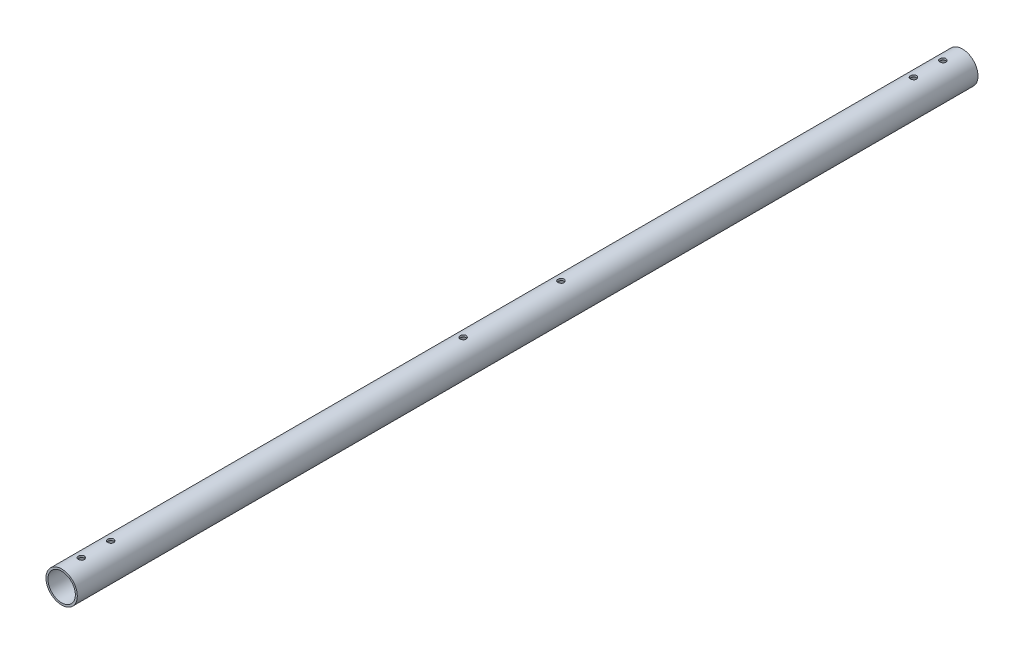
from build123d import *

# Parameters (mm, degrees)
SKETCH_1_R               = 8
SKETCH_1_R_2             = 7
EXTRUDE_1_DEPTH          = 460
CUT_EXTRUDE_1_DEPTH      = 461.139109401
CUT_EXTRUDE_1_DEPTH_BACK = 461.139109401
SKETCH_2_R               = 1.55


with BuildPart() as part:
    # Sketch 1 → Extrude 1 (new body)
    with BuildSketch(Plane.XY):
        with Locations(Location((0, 0, 0), (0, 0, 180))):
            Circle(SKETCH_1_R)
        with Locations(Location((0, 0, 0), (0, 0, 180))):
            Circle(SKETCH_1_R_2, mode=Mode.SUBTRACT)
    extrude(amount=EXTRUDE_1_DEPTH)

    # Sketch 2 → Cut-Extrude 1 (cut, two sides: drawn at the far end of the back side and taken through both)
    with BuildSketch(Plane(origin=(0, 0, 0), x_dir=(1, 0, 0), z_dir=(0, 1, 0)).offset(-CUT_EXTRUDE_1_DEPTH_BACK)):
        with Locations(Location((0, -10, 0), (0, 0, 270))):
            Circle(SKETCH_2_R)
        with Locations(Location((0, -25, 0), (0, 0, 270))):
            Circle(SKETCH_2_R)
        with Locations(Location((0, -450, 0), (0, 0, 270))):
            Circle(SKETCH_2_R)
        with Locations(Location((0, -435, 0), (0, 0, 270))):
            Circle(SKETCH_2_R)
        with Locations(Location((0, -205, 0), (0, 0, 270))):
            Circle(SKETCH_2_R)
        with Locations(Location((0, -255, 0), (0, 0, 270))):
            Circle(SKETCH_2_R)
    extrude(amount=CUT_EXTRUDE_1_DEPTH + CUT_EXTRUDE_1_DEPTH_BACK, mode=Mode.SUBTRACT)


solid = part.part
